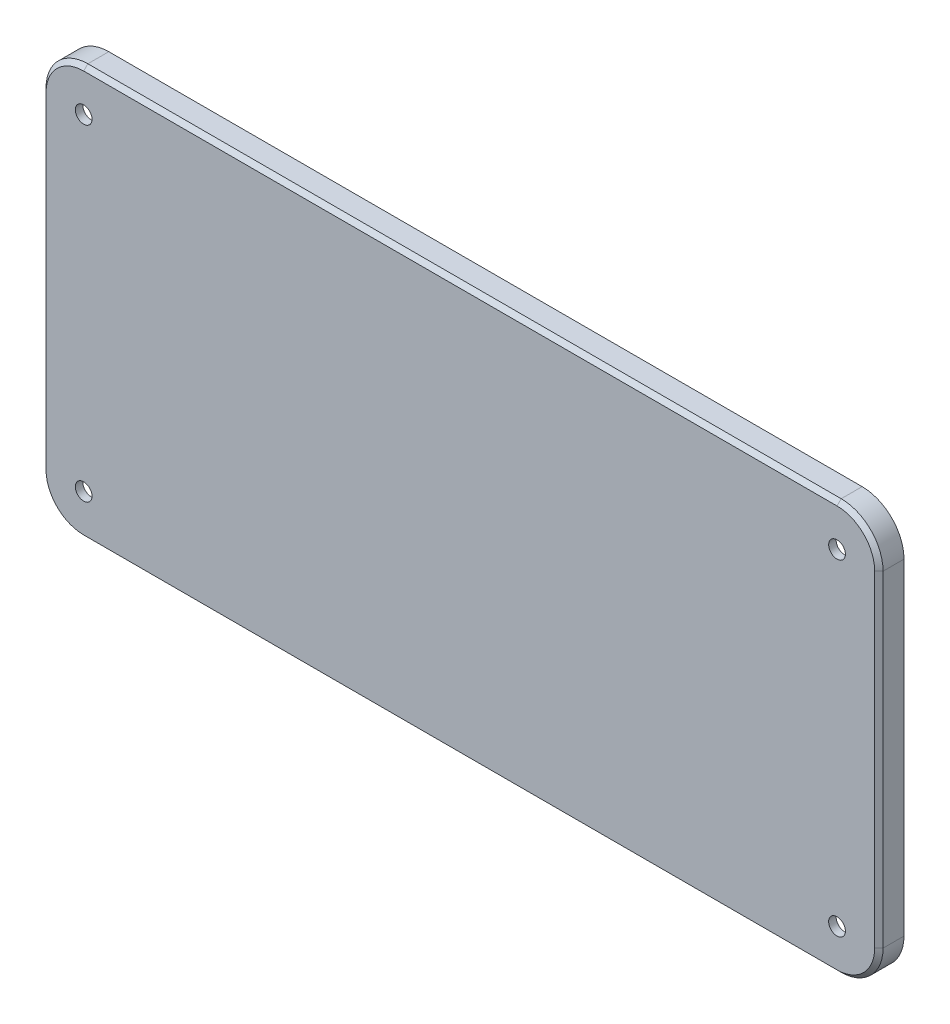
from build123d import *

# Parameters (mm, degrees)
ESQUISSE1_R        = 2
BOSS_EXTRU_1_DEPTH = 6
COQUE1_T           = -1.8
CHANFREIN1_SIZE    = 1
CONG_1_R           = 1.8


with BuildPart() as part:
    # Esquisse1 → Boss.-Extru.1 (new body)
    with BuildSketch(Plane.XY):
        with BuildLine():
            Line((90, -49), (-90, -49))
            ThreePointArc((-90, -49), (-97.071067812, -46.071067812), (-100, -39))
            Line((-100, -39), (-100, 39))
            ThreePointArc((-100, 39), (-97.071067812, 46.071067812), (-90, 49))
            Line((-90, 49), (90, 49))
            ThreePointArc((90, 49), (97.071067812, 46.071067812), (100, 39))
            Line((100, 39), (100, -39))
            ThreePointArc((100, -39), (97.071067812, -46.071067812), (90, -49))
        make_face()
        with Locations((-90, -39)):
            Circle(ESQUISSE1_R, mode=Mode.SUBTRACT)
        with Locations((90, -39)):
            Circle(ESQUISSE1_R, mode=Mode.SUBTRACT)
        with Locations((90, 39)):
            Circle(ESQUISSE1_R, mode=Mode.SUBTRACT)
        with Locations((-90, 39)):
            Circle(ESQUISSE1_R, mode=Mode.SUBTRACT)
    extrude(amount=BOSS_EXTRU_1_DEPTH)

    # Coque1
    coque1_openings = [part.faces().sort_by_distance(p)[0] for p in [
        (-92, -39, 3),
        (88, -39, 3),
        (88, 39, 3),
        (0, 0, 0),
        (-92, 39, 3),
    ]]
    offset(amount=COQUE1_T, openings=coque1_openings, kind=Kind.INTERSECTION)

    # Chanfrein1
    chanfrein1_edges = [part.edges().sort_by_distance(p)[0] for p in [
        (97.071067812, -46.071067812, 6),
        (100, 0, 6),
        (97.071067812, 46.071067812, 6),
        (0, 49, 6),
        (-97.071067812, 46.071067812, 6),
        (-100, 0, 6),
        (-97.071067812, -46.071067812, 6),
        (0, -49, 6),
    ]]
    chamfer(chanfrein1_edges, length=CHANFREIN1_SIZE)

    # Cong_1
    cong_1_edges = [part.edges().sort_by_distance(p)[0] for p in [
        (-95.798275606, -44.798275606, 4.2),
        (0, -47.2, 4.2),
        (95.798275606, -44.798275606, 4.2),
        (98.2, 0, 4.2),
        (95.798275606, 44.798275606, 4.2),
        (0, 47.2, 4.2),
        (-95.798275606, 44.798275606, 4.2),
        (-98.2, 0, 4.2),
    ]]
    fillet(cong_1_edges, radius=CONG_1_R)


solid = part.part
